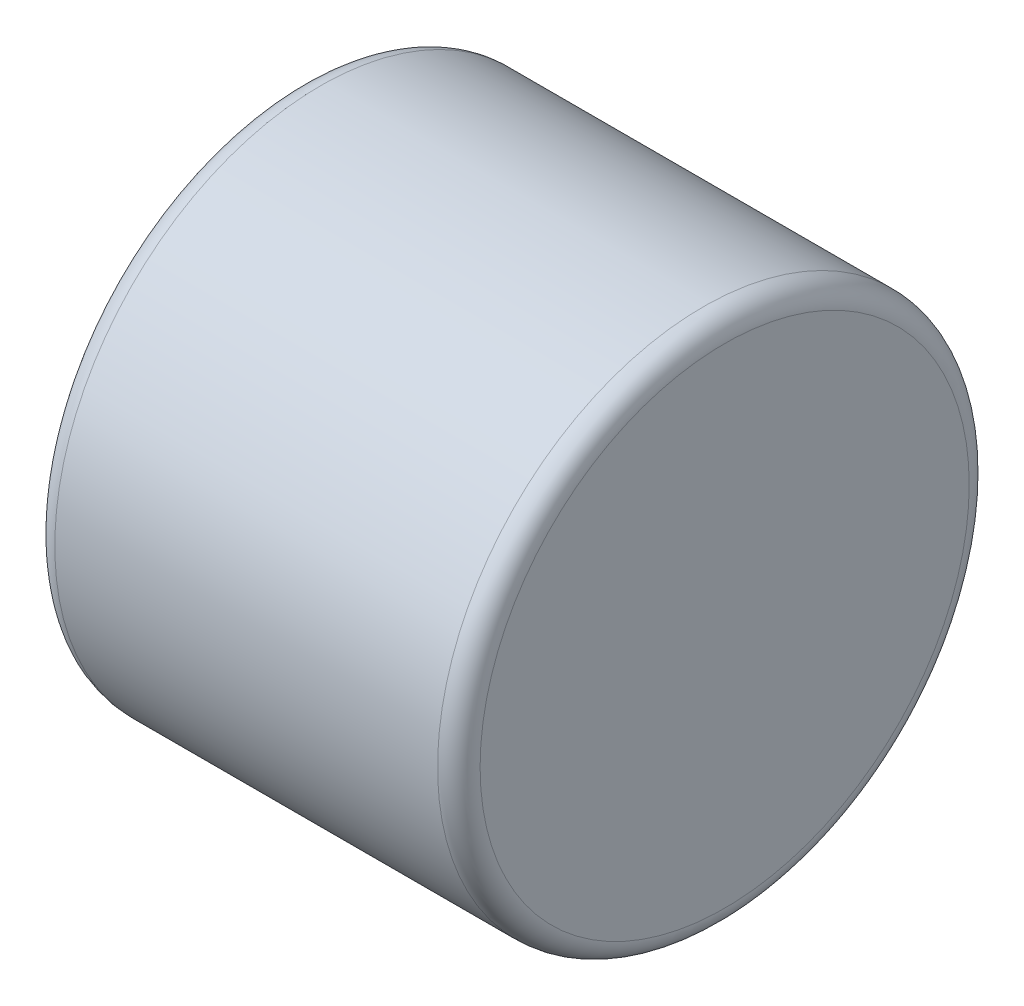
ISO-10303-21;
HEADER;
FILE_DESCRIPTION(('STEP AP214'),'2;1');
FILE_NAME('part.step','',(''),(''),'','','');
FILE_SCHEMA(('AUTOMOTIVE_DESIGN { 1 0 10303 214 1 1 1 1 }'));
ENDSEC;
DATA;
#1=APPLICATION_CONTEXT('core data for automotive mechanical design processes');
#2=APPLICATION_PROTOCOL_DEFINITION('international standard','automotive_design',2000,#1);
#3=PRODUCT_CONTEXT('',#1,'mechanical');
#4=PRODUCT('Part','Part','',(#3));
#5=PRODUCT_RELATED_PRODUCT_CATEGORY('part','',(#4));
#6=PRODUCT_DEFINITION_FORMATION('','',#4);
#7=PRODUCT_DEFINITION_CONTEXT('part definition',#1,'design');
#8=PRODUCT_DEFINITION('design','',#6,#7);
#9=PRODUCT_DEFINITION_SHAPE('','',#8);
#10=(LENGTH_UNIT() NAMED_UNIT(*) SI_UNIT(.MILLI.,.METRE.));
#11=(NAMED_UNIT(*) PLANE_ANGLE_UNIT() SI_UNIT($,.RADIAN.));
#12=(NAMED_UNIT(*) SI_UNIT($,.STERADIAN.) SOLID_ANGLE_UNIT());
#13=UNCERTAINTY_MEASURE_WITH_UNIT(LENGTH_MEASURE(1.E-05),#10,'distance_accuracy_value','');
#14=(GEOMETRIC_REPRESENTATION_CONTEXT(3) GLOBAL_UNCERTAINTY_ASSIGNED_CONTEXT((#13)) GLOBAL_UNIT_ASSIGNED_CONTEXT((#10,
#11,#12)) REPRESENTATION_CONTEXT('',''));
#15=CARTESIAN_POINT('',(0.,0.,0.));
#16=DIRECTION('',(0.,0.,1.));
#17=DIRECTION('',(1.,0.,0.));
#18=AXIS2_PLACEMENT_3D('',#15,#16,#17);
#19=CARTESIAN_POINT('',(2.54,0.,0.));
#20=DIRECTION('',(-1.,0.,0.));
#21=DIRECTION('',(0.,0.,1.));
#22=AXIS2_PLACEMENT_3D('',#19,#20,#21);
#23=CYLINDRICAL_SURFACE('',#22,1.5875);
#24=CARTESIAN_POINT('',(0.127000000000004,0.,0.));
#25=DIRECTION('',(1.,0.,0.));
#26=DIRECTION('',(0.,0.,-1.));
#27=AXIS2_PLACEMENT_3D('',#24,#25,#26);
#28=CIRCLE('',#27,1.5875);
#29=CARTESIAN_POINT('',(0.127000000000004,0.,-1.58749999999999));
#30=VERTEX_POINT('',#29);
#31=EDGE_CURVE('E40',#30,#30,#28,.T.);
#32=ORIENTED_EDGE('',*,*,#31,.T.);
#33=EDGE_LOOP('',(#32));
#34=FACE_BOUND('',#33,.T.);
#35=CARTESIAN_POINT('',(2.413,0.,0.));
#36=DIRECTION('',(1.,0.,0.));
#37=DIRECTION('',(0.,0.,-1.));
#38=AXIS2_PLACEMENT_3D('',#35,#36,#37);
#39=CIRCLE('',#38,1.5875);
#40=CARTESIAN_POINT('',(2.413,0.,-1.58750000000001));
#41=VERTEX_POINT('',#40);
#42=EDGE_CURVE('E44',#41,#41,#39,.F.);
#43=ORIENTED_EDGE('',*,*,#42,.T.);
#44=EDGE_LOOP('',(#43));
#45=FACE_BOUND('',#44,.T.);
#46=ADVANCED_FACE('F30',(#34,#45),#23,.T.);
#47=CARTESIAN_POINT('',(2.54,0.,0.));
#48=DIRECTION('',(1.,0.,0.));
#49=DIRECTION('',(0.,0.,-1.));
#50=AXIS2_PLACEMENT_3D('',#47,#48,#49);
#51=PLANE('',#50);
#52=CARTESIAN_POINT('',(2.54,0.,0.));
#53=DIRECTION('',(1.,0.,0.));
#54=DIRECTION('',(0.,0.,-1.));
#55=AXIS2_PLACEMENT_3D('',#52,#53,#54);
#56=CIRCLE('',#55,1.4605);
#57=CARTESIAN_POINT('',(2.54,0.,-1.46049999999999));
#58=VERTEX_POINT('',#57);
#59=EDGE_CURVE('E10',#58,#58,#56,.T.);
#60=ORIENTED_EDGE('',*,*,#59,.T.);
#61=EDGE_LOOP('',(#60));
#62=FACE_BOUND('',#61,.T.);
#63=ADVANCED_FACE('F63',(#62),#51,.T.);
#64=CARTESIAN_POINT('',(0.,0.,0.));
#65=DIRECTION('',(1.,0.,0.));
#66=DIRECTION('',(0.,0.,-1.));
#67=AXIS2_PLACEMENT_3D('',#64,#65,#66);
#68=PLANE('',#67);
#69=CARTESIAN_POINT('',(0.,0.,0.));
#70=DIRECTION('',(1.,0.,0.));
#71=DIRECTION('',(0.,0.,-1.));
#72=AXIS2_PLACEMENT_3D('',#69,#70,#71);
#73=CIRCLE('',#72,1.4605);
#74=CARTESIAN_POINT('',(0.,0.,-1.4605));
#75=VERTEX_POINT('',#74);
#76=EDGE_CURVE('E36',#75,#75,#73,.F.);
#77=ORIENTED_EDGE('',*,*,#76,.T.);
#78=EDGE_LOOP('',(#77));
#79=FACE_BOUND('',#78,.T.);
#80=ADVANCED_FACE('F59',(#79),#68,.F.);
#81=CARTESIAN_POINT('',(0.127000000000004,0.,0.));
#82=DIRECTION('',(1.,0.,0.));
#83=DIRECTION('',(0.,0.,-1.));
#84=AXIS2_PLACEMENT_3D('',#81,#82,#83);
#85=TOROIDAL_SURFACE('',#84,1.4605,0.127);
#86=ORIENTED_EDGE('',*,*,#76,.F.);
#87=EDGE_LOOP('',(#86));
#88=FACE_BOUND('',#87,.T.);
#89=ORIENTED_EDGE('',*,*,#31,.F.);
#90=EDGE_LOOP('',(#89));
#91=FACE_BOUND('',#90,.T.);
#92=ADVANCED_FACE('F54',(#88,#91),#85,.T.);
#93=CARTESIAN_POINT('',(2.413,0.,0.));
#94=DIRECTION('',(1.,0.,0.));
#95=DIRECTION('',(0.,0.,-1.));
#96=AXIS2_PLACEMENT_3D('',#93,#94,#95);
#97=TOROIDAL_SURFACE('',#96,1.4605,0.127);
#98=ORIENTED_EDGE('',*,*,#42,.F.);
#99=EDGE_LOOP('',(#98));
#100=FACE_BOUND('',#99,.T.);
#101=ORIENTED_EDGE('',*,*,#59,.F.);
#102=EDGE_LOOP('',(#101));
#103=FACE_BOUND('',#102,.T.);
#104=ADVANCED_FACE('F51',(#100,#103),#97,.T.);
#105=CLOSED_SHELL('',(#46,#63,#80,#92,#104));
#106=MANIFOLD_SOLID_BREP('B2',#105);
#107=ADVANCED_BREP_SHAPE_REPRESENTATION('',(#18,#106),#14);
#108=SHAPE_DEFINITION_REPRESENTATION(#9,#107);
ENDSEC;
END-ISO-10303-21;
